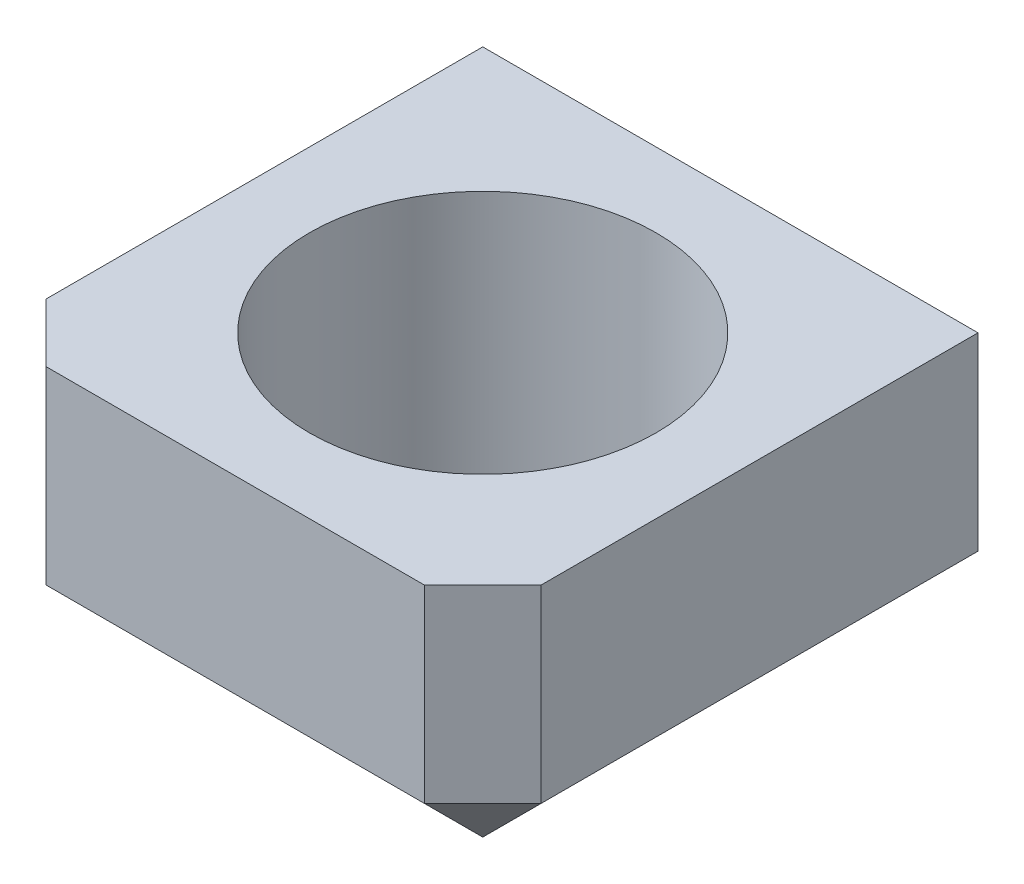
ISO-10303-21;
HEADER;
FILE_DESCRIPTION(('STEP AP214'),'2;1');
FILE_NAME('part.step','',(''),(''),'','','');
FILE_SCHEMA(('AUTOMOTIVE_DESIGN { 1 0 10303 214 1 1 1 1 }'));
ENDSEC;
DATA;
#1=APPLICATION_CONTEXT('core data for automotive mechanical design processes');
#2=APPLICATION_PROTOCOL_DEFINITION('international standard','automotive_design',2000,#1);
#3=PRODUCT_CONTEXT('',#1,'mechanical');
#4=PRODUCT('Part','Part','',(#3));
#5=PRODUCT_RELATED_PRODUCT_CATEGORY('part','',(#4));
#6=PRODUCT_DEFINITION_FORMATION('','',#4);
#7=PRODUCT_DEFINITION_CONTEXT('part definition',#1,'design');
#8=PRODUCT_DEFINITION('design','',#6,#7);
#9=PRODUCT_DEFINITION_SHAPE('','',#8);
#10=(LENGTH_UNIT() NAMED_UNIT(*) SI_UNIT(.MILLI.,.METRE.));
#11=(NAMED_UNIT(*) PLANE_ANGLE_UNIT() SI_UNIT($,.RADIAN.));
#12=(NAMED_UNIT(*) SI_UNIT($,.STERADIAN.) SOLID_ANGLE_UNIT());
#13=UNCERTAINTY_MEASURE_WITH_UNIT(LENGTH_MEASURE(1.E-05),#10,'distance_accuracy_value','');
#14=(GEOMETRIC_REPRESENTATION_CONTEXT(3) GLOBAL_UNCERTAINTY_ASSIGNED_CONTEXT((#13)) GLOBAL_UNIT_ASSIGNED_CONTEXT((#10,
#11,#12)) REPRESENTATION_CONTEXT('',''));
#15=CARTESIAN_POINT('',(0.,0.,0.));
#16=DIRECTION('',(0.,0.,1.));
#17=DIRECTION('',(1.,0.,0.));
#18=AXIS2_PLACEMENT_3D('',#15,#16,#17);
#19=CARTESIAN_POINT('',(63.5,-63.5,63.5));
#20=DIRECTION('',(1.,0.,0.));
#21=DIRECTION('',(0.,0.,-1.));
#22=AXIS2_PLACEMENT_3D('',#19,#20,#21);
#23=PLANE('',#22);
#24=DIRECTION('',(0.,-1.,0.));
#25=VECTOR('',#24,1.);
#26=CARTESIAN_POINT('',(63.5,-63.5,48.5));
#27=LINE('',#26,#25);
#28=CARTESIAN_POINT('',(63.5,0.,48.5));
#29=VERTEX_POINT('',#28);
#30=CARTESIAN_POINT('',(63.5,-48.5,48.5));
#31=VERTEX_POINT('',#30);
#32=EDGE_CURVE('E154',#29,#31,#27,.T.);
#33=ORIENTED_EDGE('',*,*,#32,.T.);
#34=DIRECTION('',(0.,0.,-1.));
#35=VECTOR('',#34,1.);
#36=CARTESIAN_POINT('',(63.5,-48.5,63.5));
#37=LINE('',#36,#35);
#38=CARTESIAN_POINT('',(63.5,-48.5,-63.5));
#39=VERTEX_POINT('',#38);
#40=EDGE_CURVE('E121',#31,#39,#37,.T.);
#41=ORIENTED_EDGE('',*,*,#40,.T.);
#42=DIRECTION('',(0.,1.,0.));
#43=VECTOR('',#42,1.);
#44=CARTESIAN_POINT('',(63.5,-63.5,-63.5));
#45=LINE('',#44,#43);
#46=CARTESIAN_POINT('',(63.5,0.,-63.5));
#47=VERTEX_POINT('',#46);
#48=EDGE_CURVE('E119',#39,#47,#45,.T.);
#49=ORIENTED_EDGE('',*,*,#48,.T.);
#50=DIRECTION('',(0.,0.,-1.));
#51=VECTOR('',#50,1.);
#52=CARTESIAN_POINT('',(63.5,0.,63.5));
#53=LINE('',#52,#51);
#54=EDGE_CURVE('E106',#29,#47,#53,.T.);
#55=ORIENTED_EDGE('',*,*,#54,.F.);
#56=EDGE_LOOP('',(#33,#41,#49,#55));
#57=FACE_BOUND('',#56,.T.);
#58=ADVANCED_FACE('F40',(#57),#23,.T.);
#59=CARTESIAN_POINT('',(-63.5,-63.5,63.5));
#60=DIRECTION('',(0.,0.,1.));
#61=DIRECTION('',(1.,0.,0.));
#62=AXIS2_PLACEMENT_3D('',#59,#60,#61);
#63=PLANE('',#62);
#64=DIRECTION('',(1.,0.,0.));
#65=VECTOR('',#64,1.);
#66=CARTESIAN_POINT('',(-63.5,-48.5,63.5));
#67=LINE('',#66,#65);
#68=CARTESIAN_POINT('',(-48.4999999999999,-48.5,63.5));
#69=VERTEX_POINT('',#68);
#70=CARTESIAN_POINT('',(48.5,-48.5,63.5));
#71=VERTEX_POINT('',#70);
#72=EDGE_CURVE('E58',#69,#71,#67,.T.);
#73=ORIENTED_EDGE('',*,*,#72,.T.);
#74=DIRECTION('',(0.,1.,0.));
#75=VECTOR('',#74,1.);
#76=CARTESIAN_POINT('',(48.5,-63.5,63.5));
#77=LINE('',#76,#75);
#78=CARTESIAN_POINT('',(48.5,0.,63.5));
#79=VERTEX_POINT('',#78);
#80=EDGE_CURVE('E159',#71,#79,#77,.T.);
#81=ORIENTED_EDGE('',*,*,#80,.T.);
#82=DIRECTION('',(1.,0.,0.));
#83=VECTOR('',#82,1.);
#84=CARTESIAN_POINT('',(-63.5,0.,63.5));
#85=LINE('',#84,#83);
#86=CARTESIAN_POINT('',(-48.4999999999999,0.,63.5));
#87=VERTEX_POINT('',#86);
#88=EDGE_CURVE('E133',#87,#79,#85,.T.);
#89=ORIENTED_EDGE('',*,*,#88,.F.);
#90=DIRECTION('',(0.,-1.,0.));
#91=VECTOR('',#90,1.);
#92=CARTESIAN_POINT('',(-48.4999999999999,-63.5,63.5));
#93=LINE('',#92,#91);
#94=EDGE_CURVE('E63',#87,#69,#93,.T.);
#95=ORIENTED_EDGE('',*,*,#94,.T.);
#96=EDGE_LOOP('',(#73,#81,#89,#95));
#97=FACE_BOUND('',#96,.T.);
#98=ADVANCED_FACE('F220',(#97),#63,.T.);
#99=CARTESIAN_POINT('',(-63.5,-63.5,63.5));
#100=DIRECTION('',(-1.,0.,0.));
#101=DIRECTION('',(0.,0.,1.));
#102=AXIS2_PLACEMENT_3D('',#99,#100,#101);
#103=PLANE('',#102);
#104=DIRECTION('',(0.,1.,0.));
#105=VECTOR('',#104,1.);
#106=CARTESIAN_POINT('',(-63.5,-63.5,-63.5));
#107=LINE('',#106,#105);
#108=CARTESIAN_POINT('',(-63.5,-48.5,-63.5));
#109=VERTEX_POINT('',#108);
#110=CARTESIAN_POINT('',(-63.5,0.,-63.5));
#111=VERTEX_POINT('',#110);
#112=EDGE_CURVE('E124',#109,#111,#107,.T.);
#113=ORIENTED_EDGE('',*,*,#112,.F.);
#114=DIRECTION('',(0.,0.,1.));
#115=VECTOR('',#114,1.);
#116=CARTESIAN_POINT('',(-63.5,-48.5,63.5));
#117=LINE('',#116,#115);
#118=CARTESIAN_POINT('',(-63.5,-48.5,48.5));
#119=VERTEX_POINT('',#118);
#120=EDGE_CURVE('E141',#109,#119,#117,.T.);
#121=ORIENTED_EDGE('',*,*,#120,.T.);
#122=DIRECTION('',(0.,1.,0.));
#123=VECTOR('',#122,1.);
#124=CARTESIAN_POINT('',(-63.5,-63.5,48.5));
#125=LINE('',#124,#123);
#126=CARTESIAN_POINT('',(-63.5,0.,48.5));
#127=VERTEX_POINT('',#126);
#128=EDGE_CURVE('E138',#119,#127,#125,.T.);
#129=ORIENTED_EDGE('',*,*,#128,.T.);
#130=DIRECTION('',(0.,0.,1.));
#131=VECTOR('',#130,1.);
#132=CARTESIAN_POINT('',(-63.5,0.,63.5));
#133=LINE('',#132,#131);
#134=EDGE_CURVE('E131',#111,#127,#133,.T.);
#135=ORIENTED_EDGE('',*,*,#134,.F.);
#136=EDGE_LOOP('',(#113,#121,#129,#135));
#137=FACE_BOUND('',#136,.T.);
#138=ADVANCED_FACE('F196',(#137),#103,.T.);
#139=CARTESIAN_POINT('',(-63.5,-63.5,-63.5));
#140=DIRECTION('',(0.,0.,-1.));
#141=DIRECTION('',(-1.,0.,0.));
#142=AXIS2_PLACEMENT_3D('',#139,#140,#141);
#143=PLANE('',#142);
#144=DIRECTION('',(-1.,0.,0.));
#145=VECTOR('',#144,1.);
#146=CARTESIAN_POINT('',(-63.5,-63.5,-63.5));
#147=LINE('',#146,#145);
#148=CARTESIAN_POINT('',(48.5,-63.5,-63.5));
#149=VERTEX_POINT('',#148);
#150=CARTESIAN_POINT('',(-48.4999999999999,-63.5,-63.5));
#151=VERTEX_POINT('',#150);
#152=EDGE_CURVE('E125',#149,#151,#147,.T.);
#153=ORIENTED_EDGE('',*,*,#152,.T.);
#154=DIRECTION('',(0.707106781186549,-0.707106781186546,0.));
#155=VECTOR('',#154,1.);
#156=CARTESIAN_POINT('',(-56.,-56.,-63.5));
#157=LINE('',#156,#155);
#158=EDGE_CURVE('E152',#151,#109,#157,.F.);
#159=ORIENTED_EDGE('',*,*,#158,.T.);
#160=ORIENTED_EDGE('',*,*,#112,.T.);
#161=DIRECTION('',(-1.,0.,0.));
#162=VECTOR('',#161,1.);
#163=CARTESIAN_POINT('',(-63.5,0.,-63.5));
#164=LINE('',#163,#162);
#165=EDGE_CURVE('E112',#47,#111,#164,.T.);
#166=ORIENTED_EDGE('',*,*,#165,.F.);
#167=ORIENTED_EDGE('',*,*,#48,.F.);
#168=DIRECTION('',(0.707106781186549,0.707106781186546,0.));
#169=VECTOR('',#168,1.);
#170=CARTESIAN_POINT('',(-7.50000000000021,-119.5,-63.5));
#171=LINE('',#170,#169);
#172=EDGE_CURVE('E150',#39,#149,#171,.F.);
#173=ORIENTED_EDGE('',*,*,#172,.T.);
#174=EDGE_LOOP('',(#153,#159,#160,#166,#167,#173));
#175=FACE_BOUND('',#174,.T.);
#176=ADVANCED_FACE('F128',(#175),#143,.T.);
#177=CARTESIAN_POINT('',(0.,-63.5,0.));
#178=DIRECTION('',(0.,-1.,0.));
#179=DIRECTION('',(0.,0.,-1.));
#180=AXIS2_PLACEMENT_3D('',#177,#178,#179);
#181=PLANE('',#180);
#182=CARTESIAN_POINT('',(0.,-63.5,0.));
#183=DIRECTION('',(0.,1.,0.));
#184=DIRECTION('',(0.,0.,1.));
#185=AXIS2_PLACEMENT_3D('',#182,#183,#184);
#186=CIRCLE('',#185,44.45);
#187=CARTESIAN_POINT('',(0.,-63.5,44.45));
#188=VERTEX_POINT('',#187);
#189=EDGE_CURVE('E116',#188,#188,#186,.T.);
#190=ORIENTED_EDGE('',*,*,#189,.T.);
#191=EDGE_LOOP('',(#190));
#192=FACE_BOUND('',#191,.T.);
#193=DIRECTION('',(-1.,0.,0.));
#194=VECTOR('',#193,1.);
#195=CARTESIAN_POINT('',(0.,-63.5,48.5));
#196=LINE('',#195,#194);
#197=CARTESIAN_POINT('',(48.5,-63.5,48.5));
#198=VERTEX_POINT('',#197);
#199=CARTESIAN_POINT('',(-48.4999999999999,-63.5,48.5));
#200=VERTEX_POINT('',#199);
#201=EDGE_CURVE('E144',#198,#200,#196,.T.);
#202=ORIENTED_EDGE('',*,*,#201,.T.);
#203=DIRECTION('',(0.,0.,-1.));
#204=VECTOR('',#203,1.);
#205=CARTESIAN_POINT('',(-48.4999999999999,-63.5,0.));
#206=LINE('',#205,#204);
#207=EDGE_CURVE('E148',#200,#151,#206,.T.);
#208=ORIENTED_EDGE('',*,*,#207,.T.);
#209=ORIENTED_EDGE('',*,*,#152,.F.);
#210=DIRECTION('',(0.,0.,1.));
#211=VECTOR('',#210,1.);
#212=CARTESIAN_POINT('',(48.5,-63.5,0.));
#213=LINE('',#212,#211);
#214=EDGE_CURVE('E146',#149,#198,#213,.T.);
#215=ORIENTED_EDGE('',*,*,#214,.T.);
#216=EDGE_LOOP('',(#202,#208,#209,#215));
#217=FACE_BOUND('',#216,.T.);
#218=ADVANCED_FACE('F308',(#192,#217),#181,.T.);
#219=CARTESIAN_POINT('',(0.,0.,0.));
#220=DIRECTION('',(0.,-1.,0.));
#221=DIRECTION('',(0.,0.,-1.));
#222=AXIS2_PLACEMENT_3D('',#219,#220,#221);
#223=PLANE('',#222);
#224=CARTESIAN_POINT('',(0.,0.,0.));
#225=DIRECTION('',(0.,1.,0.));
#226=DIRECTION('',(0.,0.,1.));
#227=AXIS2_PLACEMENT_3D('',#224,#225,#226);
#228=CIRCLE('',#227,44.45);
#229=CARTESIAN_POINT('',(0.,0.,44.45));
#230=VERTEX_POINT('',#229);
#231=EDGE_CURVE('E178',#230,#230,#228,.T.);
#232=ORIENTED_EDGE('',*,*,#231,.F.);
#233=EDGE_LOOP('',(#232));
#234=FACE_BOUND('',#233,.T.);
#235=ORIENTED_EDGE('',*,*,#88,.T.);
#236=DIRECTION('',(-0.707106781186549,0.,0.707106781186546));
#237=VECTOR('',#236,1.);
#238=CARTESIAN_POINT('',(48.5,0.,63.5));
#239=LINE('',#238,#237);
#240=EDGE_CURVE('E11',#79,#29,#239,.F.);
#241=ORIENTED_EDGE('',*,*,#240,.T.);
#242=ORIENTED_EDGE('',*,*,#54,.T.);
#243=ORIENTED_EDGE('',*,*,#165,.T.);
#244=ORIENTED_EDGE('',*,*,#134,.T.);
#245=DIRECTION('',(-0.707106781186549,0.,-0.707106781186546));
#246=VECTOR('',#245,1.);
#247=CARTESIAN_POINT('',(-63.5,0.,48.5));
#248=LINE('',#247,#246);
#249=EDGE_CURVE('E50',#127,#87,#248,.F.);
#250=ORIENTED_EDGE('',*,*,#249,.T.);
#251=EDGE_LOOP('',(#235,#241,#242,#243,#244,#250));
#252=FACE_BOUND('',#251,.T.);
#253=ADVANCED_FACE('F109',(#234,#252),#223,.F.);
#254=CARTESIAN_POINT('',(0.,-63.5,0.));
#255=DIRECTION('',(0.,1.,0.));
#256=DIRECTION('',(0.,0.,1.));
#257=AXIS2_PLACEMENT_3D('',#254,#255,#256);
#258=CYLINDRICAL_SURFACE('',#257,44.45);
#259=ORIENTED_EDGE('',*,*,#189,.F.);
#260=EDGE_LOOP('',(#259));
#261=FACE_BOUND('',#260,.T.);
#262=ORIENTED_EDGE('',*,*,#231,.T.);
#263=EDGE_LOOP('',(#262));
#264=FACE_BOUND('',#263,.T.);
#265=ADVANCED_FACE('F292',(#261,#264),#258,.F.);
#266=CARTESIAN_POINT('',(48.5,-63.5,63.5));
#267=DIRECTION('',(-0.707106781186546,0.,-0.707106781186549));
#268=DIRECTION('',(0.,1.,0.));
#269=AXIS2_PLACEMENT_3D('',#266,#267,#268);
#270=PLANE('',#269);
#271=ORIENTED_EDGE('',*,*,#240,.F.);
#272=ORIENTED_EDGE('',*,*,#80,.F.);
#273=DIRECTION('',(0.707106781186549,0.,-0.707106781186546));
#274=VECTOR('',#273,1.);
#275=CARTESIAN_POINT('',(56.,-48.5,56.));
#276=LINE('',#275,#274);
#277=EDGE_CURVE('E45',#31,#71,#276,.F.);
#278=ORIENTED_EDGE('',*,*,#277,.F.);
#279=ORIENTED_EDGE('',*,*,#32,.F.);
#280=EDGE_LOOP('',(#271,#272,#278,#279));
#281=FACE_BOUND('',#280,.T.);
#282=ADVANCED_FACE('F43',(#281),#270,.F.);
#283=CARTESIAN_POINT('',(63.5,-48.5,63.5));
#284=DIRECTION('',(-0.707106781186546,0.707106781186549,0.));
#285=DIRECTION('',(0.,0.,-1.));
#286=AXIS2_PLACEMENT_3D('',#283,#284,#285);
#287=PLANE('',#286);
#288=ORIENTED_EDGE('',*,*,#172,.F.);
#289=ORIENTED_EDGE('',*,*,#40,.F.);
#290=DIRECTION('',(-0.707106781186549,-0.707106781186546,0.));
#291=VECTOR('',#290,1.);
#292=CARTESIAN_POINT('',(48.5,-63.5,48.5));
#293=LINE('',#292,#291);
#294=EDGE_CURVE('E172',#198,#31,#293,.F.);
#295=ORIENTED_EDGE('',*,*,#294,.F.);
#296=ORIENTED_EDGE('',*,*,#214,.F.);
#297=EDGE_LOOP('',(#288,#289,#295,#296));
#298=FACE_BOUND('',#297,.T.);
#299=ADVANCED_FACE('F210',(#298),#287,.F.);
#300=CARTESIAN_POINT('',(48.5,-63.5,48.5));
#301=DIRECTION('',(0.577350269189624,-0.577350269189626,0.577350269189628));
#302=DIRECTION('',(0.,-0.707106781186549,-0.707106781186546));
#303=AXIS2_PLACEMENT_3D('',#300,#301,#302);
#304=PLANE('',#303);
#305=ORIENTED_EDGE('',*,*,#294,.T.);
#306=ORIENTED_EDGE('',*,*,#277,.T.);
#307=DIRECTION('',(0.,0.707106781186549,0.707106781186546));
#308=VECTOR('',#307,1.);
#309=CARTESIAN_POINT('',(48.5,-63.5,48.5));
#310=LINE('',#309,#308);
#311=EDGE_CURVE('E170',#198,#71,#310,.T.);
#312=ORIENTED_EDGE('',*,*,#311,.F.);
#313=EDGE_LOOP('',(#305,#306,#312));
#314=FACE_BOUND('',#313,.T.);
#315=ADVANCED_FACE('F208',(#314),#304,.T.);
#316=CARTESIAN_POINT('',(-63.5,-63.5,48.5));
#317=DIRECTION('',(0.707106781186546,0.,-0.707106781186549));
#318=DIRECTION('',(0.,1.,0.));
#319=AXIS2_PLACEMENT_3D('',#316,#317,#318);
#320=PLANE('',#319);
#321=ORIENTED_EDGE('',*,*,#249,.F.);
#322=ORIENTED_EDGE('',*,*,#128,.F.);
#323=DIRECTION('',(0.707106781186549,0.,0.707106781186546));
#324=VECTOR('',#323,1.);
#325=CARTESIAN_POINT('',(-63.5,-48.5,48.5));
#326=LINE('',#325,#324);
#327=EDGE_CURVE('E167',#69,#119,#326,.F.);
#328=ORIENTED_EDGE('',*,*,#327,.F.);
#329=ORIENTED_EDGE('',*,*,#94,.F.);
#330=EDGE_LOOP('',(#321,#322,#328,#329));
#331=FACE_BOUND('',#330,.T.);
#332=ADVANCED_FACE('F200',(#331),#320,.F.);
#333=CARTESIAN_POINT('',(-63.5,-48.5,63.5));
#334=DIRECTION('',(0.,0.707106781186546,-0.707106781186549));
#335=DIRECTION('',(1.,0.,0.));
#336=AXIS2_PLACEMENT_3D('',#333,#334,#335);
#337=PLANE('',#336);
#338=ORIENTED_EDGE('',*,*,#311,.T.);
#339=ORIENTED_EDGE('',*,*,#72,.F.);
#340=DIRECTION('',(0.,-0.707106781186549,-0.707106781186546));
#341=VECTOR('',#340,1.);
#342=CARTESIAN_POINT('',(-48.4999999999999,-56.,56.));
#343=LINE('',#342,#341);
#344=EDGE_CURVE('E164',#200,#69,#343,.F.);
#345=ORIENTED_EDGE('',*,*,#344,.F.);
#346=ORIENTED_EDGE('',*,*,#201,.F.);
#347=EDGE_LOOP('',(#338,#339,#345,#346));
#348=FACE_BOUND('',#347,.T.);
#349=ADVANCED_FACE('F207',(#348),#337,.F.);
#350=CARTESIAN_POINT('',(-63.5,-48.5,48.5));
#351=DIRECTION('',(-0.577350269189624,-0.577350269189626,0.577350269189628));
#352=DIRECTION('',(0.,-0.707106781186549,-0.707106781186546));
#353=AXIS2_PLACEMENT_3D('',#350,#351,#352);
#354=PLANE('',#353);
#355=ORIENTED_EDGE('',*,*,#344,.T.);
#356=ORIENTED_EDGE('',*,*,#327,.T.);
#357=DIRECTION('',(-0.707106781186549,0.707106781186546,0.));
#358=VECTOR('',#357,1.);
#359=CARTESIAN_POINT('',(-63.5,-48.5,48.5));
#360=LINE('',#359,#358);
#361=EDGE_CURVE('E162',#200,#119,#360,.T.);
#362=ORIENTED_EDGE('',*,*,#361,.F.);
#363=EDGE_LOOP('',(#355,#356,#362));
#364=FACE_BOUND('',#363,.T.);
#365=ADVANCED_FACE('F204',(#364),#354,.T.);
#366=CARTESIAN_POINT('',(-63.5,-48.5,63.5));
#367=DIRECTION('',(0.707106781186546,0.707106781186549,0.));
#368=DIRECTION('',(0.,0.,1.));
#369=AXIS2_PLACEMENT_3D('',#366,#367,#368);
#370=PLANE('',#369);
#371=ORIENTED_EDGE('',*,*,#158,.F.);
#372=ORIENTED_EDGE('',*,*,#207,.F.);
#373=ORIENTED_EDGE('',*,*,#361,.T.);
#374=ORIENTED_EDGE('',*,*,#120,.F.);
#375=EDGE_LOOP('',(#371,#372,#373,#374));
#376=FACE_BOUND('',#375,.T.);
#377=ADVANCED_FACE('F193',(#376),#370,.F.);
#378=CLOSED_SHELL('',(#58,#98,#138,#176,#218,#253,#265,#282,#299,#315,#332,#349,#365,#377));
#379=MANIFOLD_SOLID_BREP('B2',#378);
#380=ADVANCED_BREP_SHAPE_REPRESENTATION('',(#18,#379),#14);
#381=SHAPE_DEFINITION_REPRESENTATION(#9,#380);
ENDSEC;
END-ISO-10303-21;
